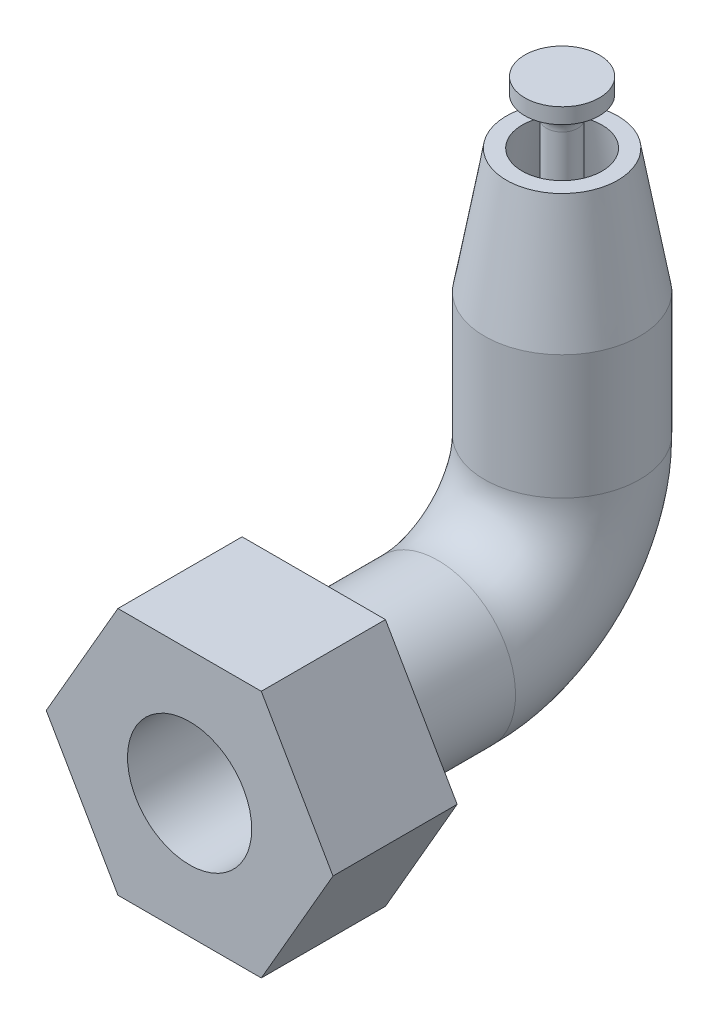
ISO-10303-21;
HEADER;
FILE_DESCRIPTION(('STEP AP214'),'2;1');
FILE_NAME('part.step','',(''),(''),'','','');
FILE_SCHEMA(('AUTOMOTIVE_DESIGN { 1 0 10303 214 1 1 1 1 }'));
ENDSEC;
DATA;
#1=APPLICATION_CONTEXT('core data for automotive mechanical design processes');
#2=APPLICATION_PROTOCOL_DEFINITION('international standard','automotive_design',2000,#1);
#3=PRODUCT_CONTEXT('',#1,'mechanical');
#4=PRODUCT('Part','Part','',(#3));
#5=PRODUCT_RELATED_PRODUCT_CATEGORY('part','',(#4));
#6=PRODUCT_DEFINITION_FORMATION('','',#4);
#7=PRODUCT_DEFINITION_CONTEXT('part definition',#1,'design');
#8=PRODUCT_DEFINITION('design','',#6,#7);
#9=PRODUCT_DEFINITION_SHAPE('','',#8);
#10=(LENGTH_UNIT() NAMED_UNIT(*) SI_UNIT(.MILLI.,.METRE.));
#11=(NAMED_UNIT(*) PLANE_ANGLE_UNIT() SI_UNIT($,.RADIAN.));
#12=(NAMED_UNIT(*) SI_UNIT($,.STERADIAN.) SOLID_ANGLE_UNIT());
#13=UNCERTAINTY_MEASURE_WITH_UNIT(LENGTH_MEASURE(1.E-05),#10,'distance_accuracy_value','');
#14=(GEOMETRIC_REPRESENTATION_CONTEXT(3) GLOBAL_UNCERTAINTY_ASSIGNED_CONTEXT((#13)) GLOBAL_UNIT_ASSIGNED_CONTEXT((#10,
#11,#12)) REPRESENTATION_CONTEXT('',''));
#15=CARTESIAN_POINT('',(0.,0.,0.));
#16=DIRECTION('',(0.,0.,1.));
#17=DIRECTION('',(1.,0.,0.));
#18=AXIS2_PLACEMENT_3D('',#15,#16,#17);
#19=CARTESIAN_POINT('',(0.,53.975,-38.7088176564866));
#20=DIRECTION('',(0.,-1.,0.));
#21=DIRECTION('',(0.,0.,-1.));
#22=AXIS2_PLACEMENT_3D('',#19,#20,#21);
#23=PLANE('',#22);
#24=CARTESIAN_POINT('',(-4.44499999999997,53.9750000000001,-58.4989658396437));
#25=DIRECTION('',(0.,1.,0.));
#26=DIRECTION('',(0.,0.,1.));
#27=AXIS2_PLACEMENT_3D('',#24,#25,#26);
#28=CIRCLE('',#27,2.54);
#29=CARTESIAN_POINT('',(-4.44499999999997,53.975,-55.9589658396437));
#30=VERTEX_POINT('',#29);
#31=EDGE_CURVE('E280',#30,#30,#28,.T.);
#32=ORIENTED_EDGE('',*,*,#31,.F.);
#33=EDGE_LOOP('',(#32));
#34=FACE_BOUND('',#33,.T.);
#35=CARTESIAN_POINT('',(4.44500000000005,53.9750000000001,-58.4989658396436));
#36=DIRECTION('',(0.,1.,0.));
#37=DIRECTION('',(0.,0.,1.));
#38=AXIS2_PLACEMENT_3D('',#35,#36,#37);
#39=CIRCLE('',#38,2.54);
#40=CARTESIAN_POINT('',(4.44500000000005,53.975,-55.9589658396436));
#41=VERTEX_POINT('',#40);
#42=EDGE_CURVE('E290',#41,#41,#39,.T.);
#43=ORIENTED_EDGE('',*,*,#42,.F.);
#44=EDGE_LOOP('',(#43));
#45=FACE_BOUND('',#44,.T.);
#46=CARTESIAN_POINT('',(8.89,53.975,-50.7999999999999));
#47=DIRECTION('',(0.,1.,0.));
#48=DIRECTION('',(0.,0.,1.));
#49=AXIS2_PLACEMENT_3D('',#46,#47,#48);
#50=CIRCLE('',#49,2.54);
#51=CARTESIAN_POINT('',(8.89,53.975,-48.2599999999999));
#52=VERTEX_POINT('',#51);
#53=EDGE_CURVE('E285',#52,#52,#50,.T.);
#54=ORIENTED_EDGE('',*,*,#53,.F.);
#55=EDGE_LOOP('',(#54));
#56=FACE_BOUND('',#55,.T.);
#57=CARTESIAN_POINT('',(4.44499999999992,53.975,-43.1010341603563));
#58=DIRECTION('',(0.,1.,0.));
#59=DIRECTION('',(0.,0.,1.));
#60=AXIS2_PLACEMENT_3D('',#57,#58,#59);
#61=CIRCLE('',#60,2.54);
#62=CARTESIAN_POINT('',(4.44499999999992,53.975,-40.5610341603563));
#63=VERTEX_POINT('',#62);
#64=EDGE_CURVE('E281',#63,#63,#61,.T.);
#65=ORIENTED_EDGE('',*,*,#64,.F.);
#66=EDGE_LOOP('',(#65));
#67=FACE_BOUND('',#66,.T.);
#68=CARTESIAN_POINT('',(-8.89,53.975,-50.8));
#69=DIRECTION('',(0.,1.,0.));
#70=DIRECTION('',(0.,0.,1.));
#71=AXIS2_PLACEMENT_3D('',#68,#69,#70);
#72=CIRCLE('',#71,2.54);
#73=CARTESIAN_POINT('',(-8.89,53.975,-48.26));
#74=VERTEX_POINT('',#73);
#75=EDGE_CURVE('E276',#74,#74,#72,.T.);
#76=ORIENTED_EDGE('',*,*,#75,.F.);
#77=EDGE_LOOP('',(#76));
#78=FACE_BOUND('',#77,.T.);
#79=CARTESIAN_POINT('',(0.,53.9750000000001,-50.8));
#80=DIRECTION('',(0.,-1.,0.));
#81=DIRECTION('',(0.,0.,-1.));
#82=AXIS2_PLACEMENT_3D('',#79,#80,#81);
#83=CIRCLE('',#82,12.0911823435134);
#84=CARTESIAN_POINT('',(0.,53.9750000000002,-62.8911823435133));
#85=VERTEX_POINT('',#84);
#86=EDGE_CURVE('E236',#85,#85,#83,.T.);
#87=ORIENTED_EDGE('',*,*,#86,.F.);
#88=EDGE_LOOP('',(#87));
#89=FACE_BOUND('',#88,.T.);
#90=CARTESIAN_POINT('',(0.,53.9750000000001,-50.8));
#91=DIRECTION('',(0.,-1.,0.));
#92=DIRECTION('',(0.,0.,-1.));
#93=AXIS2_PLACEMENT_3D('',#90,#91,#92);
#94=CIRCLE('',#93,3.17499999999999);
#95=CARTESIAN_POINT('',(0.,53.9750000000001,-53.975));
#96=VERTEX_POINT('',#95);
#97=EDGE_CURVE('E240',#96,#96,#94,.T.);
#98=ORIENTED_EDGE('',*,*,#97,.T.);
#99=EDGE_LOOP('',(#98));
#100=FACE_BOUND('',#99,.T.);
#101=CARTESIAN_POINT('',(-4.44500000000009,53.975,-43.1010341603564));
#102=DIRECTION('',(0.,1.,0.));
#103=DIRECTION('',(0.,0.,1.));
#104=AXIS2_PLACEMENT_3D('',#101,#102,#103);
#105=CIRCLE('',#104,2.54);
#106=CARTESIAN_POINT('',(-4.44500000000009,53.975,-40.5610341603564));
#107=VERTEX_POINT('',#106);
#108=EDGE_CURVE('E286',#107,#107,#105,.T.);
#109=ORIENTED_EDGE('',*,*,#108,.F.);
#110=EDGE_LOOP('',(#109));
#111=FACE_BOUND('',#110,.T.);
#112=ADVANCED_FACE('F63',(#34,#45,#56,#67,#78,#89,#100,#111),#23,.F.);
#113=CARTESIAN_POINT('',(0.,0.,25.4));
#114=DIRECTION('',(0.,0.,1.));
#115=DIRECTION('',(1.,0.,0.));
#116=AXIS2_PLACEMENT_3D('',#113,#114,#115);
#117=PLANE('',#116);
#118=DIRECTION('',(0.5,0.866025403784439,0.));
#119=VECTOR('',#118,1.);
#120=CARTESIAN_POINT('',(14.6646968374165,-25.4,25.4));
#121=LINE('',#120,#119);
#122=CARTESIAN_POINT('',(14.6646968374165,-25.4,25.4));
#123=VERTEX_POINT('',#122);
#124=CARTESIAN_POINT('',(29.329393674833,0.,25.4));
#125=VERTEX_POINT('',#124);
#126=EDGE_CURVE('E174',#123,#125,#121,.T.);
#127=ORIENTED_EDGE('',*,*,#126,.T.);
#128=DIRECTION('',(-0.5,0.866025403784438,0.));
#129=VECTOR('',#128,1.);
#130=CARTESIAN_POINT('',(29.329393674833,0.,25.4));
#131=LINE('',#130,#129);
#132=CARTESIAN_POINT('',(14.6646968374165,25.4,25.4));
#133=VERTEX_POINT('',#132);
#134=EDGE_CURVE('E121',#125,#133,#131,.T.);
#135=ORIENTED_EDGE('',*,*,#134,.T.);
#136=DIRECTION('',(-1.,0.,0.));
#137=VECTOR('',#136,1.);
#138=CARTESIAN_POINT('',(14.6646968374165,25.4,25.4));
#139=LINE('',#138,#137);
#140=CARTESIAN_POINT('',(-14.6646968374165,25.4,25.4));
#141=VERTEX_POINT('',#140);
#142=EDGE_CURVE('E135',#133,#141,#139,.T.);
#143=ORIENTED_EDGE('',*,*,#142,.T.);
#144=DIRECTION('',(-0.5,-0.866025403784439,0.));
#145=VECTOR('',#144,1.);
#146=CARTESIAN_POINT('',(-14.6646968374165,25.4,25.4));
#147=LINE('',#146,#145);
#148=CARTESIAN_POINT('',(-29.329393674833,0.,25.4));
#149=VERTEX_POINT('',#148);
#150=EDGE_CURVE('E128',#141,#149,#147,.T.);
#151=ORIENTED_EDGE('',*,*,#150,.T.);
#152=DIRECTION('',(0.5,-0.866025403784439,0.));
#153=VECTOR('',#152,1.);
#154=CARTESIAN_POINT('',(-29.329393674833,0.,25.4));
#155=LINE('',#154,#153);
#156=CARTESIAN_POINT('',(-14.6646968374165,-25.4,25.4));
#157=VERTEX_POINT('',#156);
#158=EDGE_CURVE('E133',#149,#157,#155,.T.);
#159=ORIENTED_EDGE('',*,*,#158,.T.);
#160=DIRECTION('',(1.,0.,0.));
#161=VECTOR('',#160,1.);
#162=CARTESIAN_POINT('',(-14.6646968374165,-25.4,25.4));
#163=LINE('',#162,#161);
#164=EDGE_CURVE('E83',#157,#123,#163,.T.);
#165=ORIENTED_EDGE('',*,*,#164,.T.);
#166=EDGE_LOOP('',(#127,#135,#143,#151,#159,#165));
#167=FACE_BOUND('',#166,.T.);
#168=CARTESIAN_POINT('',(0.,0.,25.4));
#169=DIRECTION('',(0.,0.,1.));
#170=DIRECTION('',(1.,0.,0.));
#171=AXIS2_PLACEMENT_3D('',#168,#169,#170);
#172=CIRCLE('',#171,12.7);
#173=CARTESIAN_POINT('',(12.7,0.,25.4));
#174=VERTEX_POINT('',#173);
#175=EDGE_CURVE('E162',#174,#174,#172,.T.);
#176=ORIENTED_EDGE('',*,*,#175,.F.);
#177=EDGE_LOOP('',(#176));
#178=FACE_BOUND('',#177,.T.);
#179=ADVANCED_FACE('F130',(#167,#178),#117,.T.);
#180=CARTESIAN_POINT('',(0.,0.,0.));
#181=DIRECTION('',(0.,0.,1.));
#182=DIRECTION('',(1.,0.,0.));
#183=AXIS2_PLACEMENT_3D('',#180,#181,#182);
#184=PLANE('',#183);
#185=CARTESIAN_POINT('',(0.,0.,0.));
#186=DIRECTION('',(0.,0.,-1.));
#187=DIRECTION('',(-1.,0.,0.));
#188=AXIS2_PLACEMENT_3D('',#185,#186,#187);
#189=CIRCLE('',#188,15.875);
#190=CARTESIAN_POINT('',(-15.875,0.,0.));
#191=VERTEX_POINT('',#190);
#192=EDGE_CURVE('E13',#191,#191,#189,.T.);
#193=ORIENTED_EDGE('',*,*,#192,.F.);
#194=EDGE_LOOP('',(#193));
#195=FACE_BOUND('',#194,.T.);
#196=DIRECTION('',(0.5,0.866025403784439,0.));
#197=VECTOR('',#196,1.);
#198=CARTESIAN_POINT('',(14.6646968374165,-25.4,0.));
#199=LINE('',#198,#197);
#200=CARTESIAN_POINT('',(14.6646968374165,-25.4,0.));
#201=VERTEX_POINT('',#200);
#202=CARTESIAN_POINT('',(29.329393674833,0.,0.));
#203=VERTEX_POINT('',#202);
#204=EDGE_CURVE('E157',#201,#203,#199,.T.);
#205=ORIENTED_EDGE('',*,*,#204,.F.);
#206=DIRECTION('',(1.,0.,0.));
#207=VECTOR('',#206,1.);
#208=CARTESIAN_POINT('',(-14.6646968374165,-25.4,0.));
#209=LINE('',#208,#207);
#210=CARTESIAN_POINT('',(-14.6646968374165,-25.4,0.));
#211=VERTEX_POINT('',#210);
#212=EDGE_CURVE('E112',#211,#201,#209,.T.);
#213=ORIENTED_EDGE('',*,*,#212,.F.);
#214=DIRECTION('',(0.5,-0.866025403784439,0.));
#215=VECTOR('',#214,1.);
#216=CARTESIAN_POINT('',(-29.329393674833,0.,0.));
#217=LINE('',#216,#215);
#218=CARTESIAN_POINT('',(-29.329393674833,0.,0.));
#219=VERTEX_POINT('',#218);
#220=EDGE_CURVE('E106',#219,#211,#217,.T.);
#221=ORIENTED_EDGE('',*,*,#220,.F.);
#222=DIRECTION('',(-0.5,-0.866025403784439,0.));
#223=VECTOR('',#222,1.);
#224=CARTESIAN_POINT('',(-14.6646968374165,25.4,0.));
#225=LINE('',#224,#223);
#226=CARTESIAN_POINT('',(-14.6646968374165,25.4,0.));
#227=VERTEX_POINT('',#226);
#228=EDGE_CURVE('E144',#227,#219,#225,.T.);
#229=ORIENTED_EDGE('',*,*,#228,.F.);
#230=DIRECTION('',(-1.,0.,0.));
#231=VECTOR('',#230,1.);
#232=CARTESIAN_POINT('',(14.6646968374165,25.4,0.));
#233=LINE('',#232,#231);
#234=CARTESIAN_POINT('',(14.6646968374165,25.4,0.));
#235=VERTEX_POINT('',#234);
#236=EDGE_CURVE('E165',#235,#227,#233,.T.);
#237=ORIENTED_EDGE('',*,*,#236,.F.);
#238=DIRECTION('',(-0.5,0.866025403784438,0.));
#239=VECTOR('',#238,1.);
#240=CARTESIAN_POINT('',(29.329393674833,0.,0.));
#241=LINE('',#240,#239);
#242=EDGE_CURVE('E161',#203,#235,#241,.T.);
#243=ORIENTED_EDGE('',*,*,#242,.F.);
#244=EDGE_LOOP('',(#205,#213,#221,#229,#237,#243));
#245=FACE_BOUND('',#244,.T.);
#246=ADVANCED_FACE('F191',(#195,#245),#184,.F.);
#247=CARTESIAN_POINT('',(14.6646968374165,-25.4,25.4));
#248=DIRECTION('',(-0.866025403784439,0.5,0.));
#249=DIRECTION('',(-0.5,-0.866025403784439,0.));
#250=AXIS2_PLACEMENT_3D('',#247,#248,#249);
#251=PLANE('',#250);
#252=ORIENTED_EDGE('',*,*,#204,.T.);
#253=DIRECTION('',(0.,0.,-1.));
#254=VECTOR('',#253,1.);
#255=CARTESIAN_POINT('',(29.329393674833,0.,25.4));
#256=LINE('',#255,#254);
#257=EDGE_CURVE('E74',#125,#203,#256,.T.);
#258=ORIENTED_EDGE('',*,*,#257,.F.);
#259=ORIENTED_EDGE('',*,*,#126,.F.);
#260=DIRECTION('',(0.,0.,-1.));
#261=VECTOR('',#260,1.);
#262=CARTESIAN_POINT('',(14.6646968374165,-25.4,25.4));
#263=LINE('',#262,#261);
#264=EDGE_CURVE('E153',#123,#201,#263,.T.);
#265=ORIENTED_EDGE('',*,*,#264,.T.);
#266=EDGE_LOOP('',(#252,#258,#259,#265));
#267=FACE_BOUND('',#266,.T.);
#268=ADVANCED_FACE('F65',(#267),#251,.F.);
#269=CARTESIAN_POINT('',(29.329393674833,0.,25.4));
#270=DIRECTION('',(-0.866025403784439,-0.5,0.));
#271=DIRECTION('',(0.5,-0.866025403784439,0.));
#272=AXIS2_PLACEMENT_3D('',#269,#270,#271);
#273=PLANE('',#272);
#274=ORIENTED_EDGE('',*,*,#242,.T.);
#275=DIRECTION('',(0.,0.,-1.));
#276=VECTOR('',#275,1.);
#277=CARTESIAN_POINT('',(14.6646968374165,25.4,25.4));
#278=LINE('',#277,#276);
#279=EDGE_CURVE('E181',#133,#235,#278,.T.);
#280=ORIENTED_EDGE('',*,*,#279,.F.);
#281=ORIENTED_EDGE('',*,*,#134,.F.);
#282=ORIENTED_EDGE('',*,*,#257,.T.);
#283=EDGE_LOOP('',(#274,#280,#281,#282));
#284=FACE_BOUND('',#283,.T.);
#285=ADVANCED_FACE('F186',(#284),#273,.F.);
#286=CARTESIAN_POINT('',(14.6646968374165,25.4,25.4));
#287=DIRECTION('',(0.,-1.,0.));
#288=DIRECTION('',(0.,0.,-1.));
#289=AXIS2_PLACEMENT_3D('',#286,#287,#288);
#290=PLANE('',#289);
#291=ORIENTED_EDGE('',*,*,#236,.T.);
#292=DIRECTION('',(0.,0.,-1.));
#293=VECTOR('',#292,1.);
#294=CARTESIAN_POINT('',(-14.6646968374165,25.4,25.4));
#295=LINE('',#294,#293);
#296=EDGE_CURVE('E146',#141,#227,#295,.T.);
#297=ORIENTED_EDGE('',*,*,#296,.F.);
#298=ORIENTED_EDGE('',*,*,#142,.F.);
#299=ORIENTED_EDGE('',*,*,#279,.T.);
#300=EDGE_LOOP('',(#291,#297,#298,#299));
#301=FACE_BOUND('',#300,.T.);
#302=ADVANCED_FACE('F194',(#301),#290,.F.);
#303=CARTESIAN_POINT('',(-14.6646968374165,25.4,25.4));
#304=DIRECTION('',(0.866025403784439,-0.5,0.));
#305=DIRECTION('',(0.5,0.866025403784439,0.));
#306=AXIS2_PLACEMENT_3D('',#303,#304,#305);
#307=PLANE('',#306);
#308=ORIENTED_EDGE('',*,*,#228,.T.);
#309=DIRECTION('',(0.,0.,-1.));
#310=VECTOR('',#309,1.);
#311=CARTESIAN_POINT('',(-29.329393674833,0.,25.4));
#312=LINE('',#311,#310);
#313=EDGE_CURVE('E141',#149,#219,#312,.T.);
#314=ORIENTED_EDGE('',*,*,#313,.F.);
#315=ORIENTED_EDGE('',*,*,#150,.F.);
#316=ORIENTED_EDGE('',*,*,#296,.T.);
#317=EDGE_LOOP('',(#308,#314,#315,#316));
#318=FACE_BOUND('',#317,.T.);
#319=ADVANCED_FACE('F142',(#318),#307,.F.);
#320=CARTESIAN_POINT('',(-29.329393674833,0.,25.4));
#321=DIRECTION('',(0.866025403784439,0.5,0.));
#322=DIRECTION('',(-0.5,0.866025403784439,0.));
#323=AXIS2_PLACEMENT_3D('',#320,#321,#322);
#324=PLANE('',#323);
#325=ORIENTED_EDGE('',*,*,#220,.T.);
#326=DIRECTION('',(0.,0.,-1.));
#327=VECTOR('',#326,1.);
#328=CARTESIAN_POINT('',(-14.6646968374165,-25.4,25.4));
#329=LINE('',#328,#327);
#330=EDGE_CURVE('E147',#157,#211,#329,.T.);
#331=ORIENTED_EDGE('',*,*,#330,.F.);
#332=ORIENTED_EDGE('',*,*,#158,.F.);
#333=ORIENTED_EDGE('',*,*,#313,.T.);
#334=EDGE_LOOP('',(#325,#331,#332,#333));
#335=FACE_BOUND('',#334,.T.);
#336=ADVANCED_FACE('F149',(#335),#324,.F.);
#337=CARTESIAN_POINT('',(-14.6646968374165,-25.4,25.4));
#338=DIRECTION('',(0.,1.,0.));
#339=DIRECTION('',(-1.,0.,0.));
#340=AXIS2_PLACEMENT_3D('',#337,#338,#339);
#341=PLANE('',#340);
#342=ORIENTED_EDGE('',*,*,#212,.T.);
#343=ORIENTED_EDGE('',*,*,#264,.F.);
#344=ORIENTED_EDGE('',*,*,#164,.F.);
#345=ORIENTED_EDGE('',*,*,#330,.T.);
#346=EDGE_LOOP('',(#342,#343,#344,#345));
#347=FACE_BOUND('',#346,.T.);
#348=ADVANCED_FACE('F355',(#347),#341,.F.);
#349=CARTESIAN_POINT('',(0.,0.,25.4));
#350=DIRECTION('',(0.,0.,-1.));
#351=DIRECTION('',(-1.,0.,0.));
#352=AXIS2_PLACEMENT_3D('',#349,#350,#351);
#353=CYLINDRICAL_SURFACE('',#352,12.7);
#354=ORIENTED_EDGE('',*,*,#175,.T.);
#355=EDGE_LOOP('',(#354));
#356=FACE_BOUND('',#355,.T.);
#357=CARTESIAN_POINT('',(0.,0.,-25.4));
#358=DIRECTION('',(0.,0.,-1.));
#359=DIRECTION('',(-1.,0.,0.));
#360=AXIS2_PLACEMENT_3D('',#357,#358,#359);
#361=CIRCLE('',#360,12.7);
#362=CARTESIAN_POINT('',(0.,-12.7,-25.4));
#363=VERTEX_POINT('',#362);
#364=EDGE_CURVE('E218',#363,#363,#361,.F.);
#365=ORIENTED_EDGE('',*,*,#364,.F.);
#366=EDGE_LOOP('',(#365));
#367=FACE_BOUND('',#366,.T.);
#368=ADVANCED_FACE('F343',(#356,#367),#353,.F.);
#369=CARTESIAN_POINT('',(0.,0.,0.));
#370=DIRECTION('',(0.,0.,-1.));
#371=DIRECTION('',(-1.,0.,0.));
#372=AXIS2_PLACEMENT_3D('',#369,#370,#371);
#373=CYLINDRICAL_SURFACE('',#372,15.875);
#374=CARTESIAN_POINT('',(0.,0.,-25.4));
#375=DIRECTION('',(0.,0.,-1.));
#376=DIRECTION('',(-1.,0.,0.));
#377=AXIS2_PLACEMENT_3D('',#374,#375,#376);
#378=CIRCLE('',#377,15.875);
#379=CARTESIAN_POINT('',(0.,-15.875,-25.4));
#380=VERTEX_POINT('',#379);
#381=EDGE_CURVE('E210',#380,#380,#378,.T.);
#382=ORIENTED_EDGE('',*,*,#381,.F.);
#383=EDGE_LOOP('',(#382));
#384=FACE_BOUND('',#383,.T.);
#385=ORIENTED_EDGE('',*,*,#192,.T.);
#386=EDGE_LOOP('',(#385));
#387=FACE_BOUND('',#386,.T.);
#388=ADVANCED_FACE('F334',(#384,#387),#373,.T.);
#389=CARTESIAN_POINT('',(0.,25.4,-25.4));
#390=DIRECTION('',(1.,0.,0.));
#391=DIRECTION('',(0.,0.,-1.));
#392=AXIS2_PLACEMENT_3D('',#389,#390,#391);
#393=TOROIDAL_SURFACE('',#392,25.4,15.875);
#394=CARTESIAN_POINT('',(0.,25.4,-50.8));
#395=DIRECTION('',(0.,1.,0.));
#396=DIRECTION('',(-1.,0.,0.));
#397=AXIS2_PLACEMENT_3D('',#394,#395,#396);
#398=CIRCLE('',#397,15.875);
#399=CARTESIAN_POINT('',(0.,25.4,-66.675));
#400=VERTEX_POINT('',#399);
#401=EDGE_CURVE('E205',#400,#400,#398,.T.);
#402=CARTESIAN_POINT('',(0.,25.4,-25.4));
#403=DIRECTION('',(1.,0.,0.));
#404=DIRECTION('',(0.,0.,-1.));
#405=AXIS2_PLACEMENT_3D('',#402,#403,#404);
#406=CIRCLE('',#405,41.275);
#407=EDGE_CURVE('',#380,#400,#406,.T.);
#408=ORIENTED_EDGE('',*,*,#381,.T.);
#409=ORIENTED_EDGE('',*,*,#401,.F.);
#410=ORIENTED_EDGE('',*,*,#407,.T.);
#411=ORIENTED_EDGE('',*,*,#407,.F.);
#412=EDGE_LOOP('',(#408,#410,#409,#411));
#413=FACE_BOUND('',#412,.T.);
#414=ADVANCED_FACE('F346',(#413),#393,.T.);
#415=CARTESIAN_POINT('',(0.,25.4,-50.8));
#416=DIRECTION('',(0.,1.,0.));
#417=DIRECTION('',(0.,0.,1.));
#418=AXIS2_PLACEMENT_3D('',#415,#416,#417);
#419=CYLINDRICAL_SURFACE('',#418,15.875);
#420=CARTESIAN_POINT('',(0.,50.8,-50.8));
#421=DIRECTION('',(0.,1.,0.));
#422=DIRECTION('',(-1.,0.,0.));
#423=AXIS2_PLACEMENT_3D('',#420,#421,#422);
#424=CIRCLE('',#423,15.875);
#425=CARTESIAN_POINT('',(-15.875,50.8,-50.8));
#426=VERTEX_POINT('',#425);
#427=EDGE_CURVE('E209',#426,#426,#424,.T.);
#428=ORIENTED_EDGE('',*,*,#427,.F.);
#429=EDGE_LOOP('',(#428));
#430=FACE_BOUND('',#429,.T.);
#431=ORIENTED_EDGE('',*,*,#401,.T.);
#432=EDGE_LOOP('',(#431));
#433=FACE_BOUND('',#432,.T.);
#434=ADVANCED_FACE('F338',(#430,#433),#419,.T.);
#435=CARTESIAN_POINT('',(0.,25.4,-25.4));
#436=DIRECTION('',(1.,0.,0.));
#437=DIRECTION('',(0.,0.,-1.));
#438=AXIS2_PLACEMENT_3D('',#435,#436,#437);
#439=TOROIDAL_SURFACE('',#438,25.4,12.7);
#440=CARTESIAN_POINT('',(0.,25.4,-50.8));
#441=DIRECTION('',(0.,1.,0.));
#442=DIRECTION('',(-1.,0.,0.));
#443=AXIS2_PLACEMENT_3D('',#440,#441,#442);
#444=CIRCLE('',#443,12.7);
#445=CARTESIAN_POINT('',(0.,25.4,-63.5));
#446=VERTEX_POINT('',#445);
#447=EDGE_CURVE('E222',#446,#446,#444,.F.);
#448=CARTESIAN_POINT('',(0.,25.4,-25.4));
#449=DIRECTION('',(1.,0.,0.));
#450=DIRECTION('',(0.,0.,-1.));
#451=AXIS2_PLACEMENT_3D('',#448,#449,#450);
#452=CIRCLE('',#451,38.1);
#453=EDGE_CURVE('',#363,#446,#452,.T.);
#454=ORIENTED_EDGE('',*,*,#364,.T.);
#455=ORIENTED_EDGE('',*,*,#447,.F.);
#456=ORIENTED_EDGE('',*,*,#453,.T.);
#457=ORIENTED_EDGE('',*,*,#453,.F.);
#458=EDGE_LOOP('',(#454,#456,#455,#457));
#459=FACE_BOUND('',#458,.T.);
#460=ADVANCED_FACE('F335',(#459),#439,.F.);
#461=CARTESIAN_POINT('',(0.,25.4,-50.8));
#462=DIRECTION('',(0.,1.,0.));
#463=DIRECTION('',(0.,0.,1.));
#464=AXIS2_PLACEMENT_3D('',#461,#462,#463);
#465=CYLINDRICAL_SURFACE('',#464,12.7);
#466=CARTESIAN_POINT('',(0.,50.8,-50.8));
#467=DIRECTION('',(0.,1.,0.));
#468=DIRECTION('',(-1.,0.,0.));
#469=AXIS2_PLACEMENT_3D('',#466,#467,#468);
#470=CIRCLE('',#469,12.7);
#471=CARTESIAN_POINT('',(-12.7,50.8,-50.8));
#472=VERTEX_POINT('',#471);
#473=EDGE_CURVE('E204',#472,#472,#470,.F.);
#474=ORIENTED_EDGE('',*,*,#473,.F.);
#475=EDGE_LOOP('',(#474));
#476=FACE_BOUND('',#475,.T.);
#477=ORIENTED_EDGE('',*,*,#447,.T.);
#478=EDGE_LOOP('',(#477));
#479=FACE_BOUND('',#478,.T.);
#480=ADVANCED_FACE('F332',(#476,#479),#465,.F.);
#481=CARTESIAN_POINT('',(0.,50.8,-50.8));
#482=DIRECTION('',(0.,1.,0.));
#483=DIRECTION('',(0.,0.,1.));
#484=AXIS2_PLACEMENT_3D('',#481,#482,#483);
#485=PLANE('',#484);
#486=CARTESIAN_POINT('',(-4.44499999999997,50.8000000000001,-58.4989658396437));
#487=DIRECTION('',(0.,1.,0.));
#488=DIRECTION('',(0.,0.,1.));
#489=AXIS2_PLACEMENT_3D('',#486,#487,#488);
#490=CIRCLE('',#489,2.54);
#491=CARTESIAN_POINT('',(-4.44499999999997,50.8,-55.9589658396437));
#492=VERTEX_POINT('',#491);
#493=EDGE_CURVE('E256',#492,#492,#490,.T.);
#494=ORIENTED_EDGE('',*,*,#493,.T.);
#495=EDGE_LOOP('',(#494));
#496=FACE_BOUND('',#495,.T.);
#497=CARTESIAN_POINT('',(4.44500000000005,50.8000000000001,-58.4989658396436));
#498=DIRECTION('',(0.,1.,0.));
#499=DIRECTION('',(0.,0.,1.));
#500=AXIS2_PLACEMENT_3D('',#497,#498,#499);
#501=CIRCLE('',#500,2.54);
#502=CARTESIAN_POINT('',(4.44500000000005,50.8,-55.9589658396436));
#503=VERTEX_POINT('',#502);
#504=EDGE_CURVE('E260',#503,#503,#501,.T.);
#505=ORIENTED_EDGE('',*,*,#504,.T.);
#506=EDGE_LOOP('',(#505));
#507=FACE_BOUND('',#506,.T.);
#508=CARTESIAN_POINT('',(8.89,50.8,-50.7999999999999));
#509=DIRECTION('',(0.,1.,0.));
#510=DIRECTION('',(0.,0.,1.));
#511=AXIS2_PLACEMENT_3D('',#508,#509,#510);
#512=CIRCLE('',#511,2.54);
#513=CARTESIAN_POINT('',(8.89,50.8,-48.2599999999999));
#514=VERTEX_POINT('',#513);
#515=EDGE_CURVE('E264',#514,#514,#512,.T.);
#516=ORIENTED_EDGE('',*,*,#515,.T.);
#517=EDGE_LOOP('',(#516));
#518=FACE_BOUND('',#517,.T.);
#519=CARTESIAN_POINT('',(4.44499999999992,50.8,-43.1010341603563));
#520=DIRECTION('',(0.,1.,0.));
#521=DIRECTION('',(0.,0.,1.));
#522=AXIS2_PLACEMENT_3D('',#519,#520,#521);
#523=CIRCLE('',#522,2.54);
#524=CARTESIAN_POINT('',(4.44499999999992,50.8,-40.5610341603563));
#525=VERTEX_POINT('',#524);
#526=EDGE_CURVE('E268',#525,#525,#523,.T.);
#527=ORIENTED_EDGE('',*,*,#526,.T.);
#528=EDGE_LOOP('',(#527));
#529=FACE_BOUND('',#528,.T.);
#530=CARTESIAN_POINT('',(-4.44500000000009,50.8,-43.1010341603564));
#531=DIRECTION('',(0.,1.,0.));
#532=DIRECTION('',(0.,0.,1.));
#533=AXIS2_PLACEMENT_3D('',#530,#531,#532);
#534=CIRCLE('',#533,2.54);
#535=CARTESIAN_POINT('',(-4.44500000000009,50.8,-40.5610341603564));
#536=VERTEX_POINT('',#535);
#537=EDGE_CURVE('E67',#536,#536,#534,.T.);
#538=ORIENTED_EDGE('',*,*,#537,.T.);
#539=EDGE_LOOP('',(#538));
#540=FACE_BOUND('',#539,.T.);
#541=CARTESIAN_POINT('',(-8.89,50.8,-50.8));
#542=DIRECTION('',(0.,1.,0.));
#543=DIRECTION('',(0.,0.,1.));
#544=AXIS2_PLACEMENT_3D('',#541,#542,#543);
#545=CIRCLE('',#544,2.54);
#546=CARTESIAN_POINT('',(-8.89,50.8,-48.26));
#547=VERTEX_POINT('',#546);
#548=EDGE_CURVE('E272',#547,#547,#545,.T.);
#549=ORIENTED_EDGE('',*,*,#548,.T.);
#550=EDGE_LOOP('',(#549));
#551=FACE_BOUND('',#550,.T.);
#552=ORIENTED_EDGE('',*,*,#473,.T.);
#553=EDGE_LOOP('',(#552));
#554=FACE_BOUND('',#553,.T.);
#555=ADVANCED_FACE('F328',(#496,#507,#518,#529,#540,#551,#554),#485,.F.);
#556=CARTESIAN_POINT('',(0.,76.2,-50.7999999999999));
#557=DIRECTION('',(0.,-1.,0.));
#558=DIRECTION('',(0.,0.,-1.));
#559=AXIS2_PLACEMENT_3D('',#556,#557,#558);
#560=CONICAL_SURFACE('',#559,11.3962946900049,0.174532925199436);
#561=ORIENTED_EDGE('',*,*,#427,.T.);
#562=EDGE_LOOP('',(#561));
#563=FACE_BOUND('',#562,.T.);
#564=CARTESIAN_POINT('',(0.,76.2,-50.7999999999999));
#565=DIRECTION('',(0.,-1.,0.));
#566=DIRECTION('',(0.,0.,-1.));
#567=AXIS2_PLACEMENT_3D('',#564,#565,#566);
#568=CIRCLE('',#567,11.3962946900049);
#569=CARTESIAN_POINT('',(0.,76.2000000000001,-62.1962946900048));
#570=VERTEX_POINT('',#569);
#571=EDGE_CURVE('E213',#570,#570,#568,.T.);
#572=ORIENTED_EDGE('',*,*,#571,.T.);
#573=EDGE_LOOP('',(#572));
#574=FACE_BOUND('',#573,.T.);
#575=ADVANCED_FACE('F324',(#563,#574),#560,.T.);
#576=CARTESIAN_POINT('',(0.,76.2,-39.403705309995));
#577=DIRECTION('',(0.,-1.,0.));
#578=DIRECTION('',(0.,0.,-1.));
#579=AXIS2_PLACEMENT_3D('',#576,#577,#578);
#580=PLANE('',#579);
#581=ORIENTED_EDGE('',*,*,#571,.F.);
#582=EDGE_LOOP('',(#581));
#583=FACE_BOUND('',#582,.T.);
#584=CARTESIAN_POINT('',(0.,76.2,-50.7999999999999));
#585=DIRECTION('',(0.,-1.,0.));
#586=DIRECTION('',(0.,0.,-1.));
#587=AXIS2_PLACEMENT_3D('',#584,#585,#586);
#588=CIRCLE('',#587,8.17231519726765);
#589=CARTESIAN_POINT('',(0.,76.2000000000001,-58.9723151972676));
#590=VERTEX_POINT('',#589);
#591=EDGE_CURVE('E232',#590,#590,#588,.T.);
#592=ORIENTED_EDGE('',*,*,#591,.T.);
#593=EDGE_LOOP('',(#592));
#594=FACE_BOUND('',#593,.T.);
#595=ADVANCED_FACE('F320',(#583,#594),#580,.F.);
#596=CARTESIAN_POINT('',(0.,53.9750000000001,-50.8));
#597=DIRECTION('',(0.,-1.,0.));
#598=DIRECTION('',(0.,0.,-1.));
#599=AXIS2_PLACEMENT_3D('',#596,#597,#598);
#600=CONICAL_SURFACE('',#599,12.0911823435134,0.174532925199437);
#601=ORIENTED_EDGE('',*,*,#591,.F.);
#602=EDGE_LOOP('',(#601));
#603=FACE_BOUND('',#602,.T.);
#604=ORIENTED_EDGE('',*,*,#86,.T.);
#605=EDGE_LOOP('',(#604));
#606=FACE_BOUND('',#605,.T.);
#607=ADVANCED_FACE('F317',(#603,#606),#600,.F.);
#608=CARTESIAN_POINT('',(0.,-949.2,-50.8000000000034));
#609=DIRECTION('',(0.,-1.,0.));
#610=DIRECTION('',(0.,0.,-1.));
#611=AXIS2_PLACEMENT_3D('',#608,#609,#610);
#612=CYLINDRICAL_SURFACE('',#611,3.17499999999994);
#613=ORIENTED_EDGE('',*,*,#97,.F.);
#614=EDGE_LOOP('',(#613));
#615=FACE_BOUND('',#614,.T.);
#616=CARTESIAN_POINT('',(0.,81.28,-50.7999999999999));
#617=DIRECTION('',(0.,-1.,0.));
#618=DIRECTION('',(0.,0.,-1.));
#619=AXIS2_PLACEMENT_3D('',#616,#617,#618);
#620=CIRCLE('',#619,3.1749999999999);
#621=CARTESIAN_POINT('',(0.,81.28,-53.9749999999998));
#622=VERTEX_POINT('',#621);
#623=EDGE_CURVE('E244',#622,#622,#620,.T.);
#624=ORIENTED_EDGE('',*,*,#623,.T.);
#625=EDGE_LOOP('',(#624));
#626=FACE_BOUND('',#625,.T.);
#627=ADVANCED_FACE('F315',(#615,#626),#612,.T.);
#628=CARTESIAN_POINT('',(0.,81.28,-50.7999999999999));
#629=DIRECTION('',(0.,-1.,0.));
#630=DIRECTION('',(0.,0.,-1.));
#631=AXIS2_PLACEMENT_3D('',#628,#629,#630);
#632=TOROIDAL_SURFACE('',#631,7.61999999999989,4.445);
#633=ORIENTED_EDGE('',*,*,#623,.F.);
#634=EDGE_LOOP('',(#633));
#635=FACE_BOUND('',#634,.T.);
#636=CARTESIAN_POINT('',(0.,85.7250000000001,-50.7999999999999));
#637=DIRECTION('',(0.,-1.,0.));
#638=DIRECTION('',(0.,0.,-1.));
#639=AXIS2_PLACEMENT_3D('',#636,#637,#638);
#640=CIRCLE('',#639,7.61999999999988);
#641=CARTESIAN_POINT('',(0.,85.7250000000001,-58.4199999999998));
#642=VERTEX_POINT('',#641);
#643=EDGE_CURVE('E248',#642,#642,#640,.T.);
#644=ORIENTED_EDGE('',*,*,#643,.T.);
#645=EDGE_LOOP('',(#644));
#646=FACE_BOUND('',#645,.T.);
#647=ADVANCED_FACE('F475',(#635,#646),#632,.F.);
#648=CARTESIAN_POINT('',(0.,-949.2,-50.8000000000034));
#649=DIRECTION('',(0.,-1.,0.));
#650=DIRECTION('',(0.,0.,-1.));
#651=AXIS2_PLACEMENT_3D('',#648,#649,#650);
#652=CYLINDRICAL_SURFACE('',#651,7.61999999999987);
#653=ORIENTED_EDGE('',*,*,#643,.F.);
#654=EDGE_LOOP('',(#653));
#655=FACE_BOUND('',#654,.T.);
#656=CARTESIAN_POINT('',(0.,88.9,-50.7999999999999));
#657=DIRECTION('',(0.,-1.,0.));
#658=DIRECTION('',(0.,0.,-1.));
#659=AXIS2_PLACEMENT_3D('',#656,#657,#658);
#660=CIRCLE('',#659,7.61999999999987);
#661=CARTESIAN_POINT('',(0.,88.9,-58.4199999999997));
#662=VERTEX_POINT('',#661);
#663=EDGE_CURVE('E252',#662,#662,#660,.T.);
#664=ORIENTED_EDGE('',*,*,#663,.T.);
#665=EDGE_LOOP('',(#664));
#666=FACE_BOUND('',#665,.T.);
#667=ADVANCED_FACE('F472',(#655,#666),#652,.T.);
#668=CARTESIAN_POINT('',(0.,88.9,-50.8));
#669=DIRECTION('',(0.,-1.,0.));
#670=DIRECTION('',(0.,0.,-1.));
#671=AXIS2_PLACEMENT_3D('',#668,#669,#670);
#672=PLANE('',#671);
#673=ORIENTED_EDGE('',*,*,#663,.F.);
#674=EDGE_LOOP('',(#673));
#675=FACE_BOUND('',#674,.T.);
#676=ADVANCED_FACE('F396',(#675),#672,.F.);
#677=CARTESIAN_POINT('',(-8.89,22.225,-50.8000000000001));
#678=DIRECTION('',(0.,1.,0.));
#679=DIRECTION('',(0.,0.,1.));
#680=AXIS2_PLACEMENT_3D('',#677,#678,#679);
#681=CYLINDRICAL_SURFACE('',#680,2.54);
#682=ORIENTED_EDGE('',*,*,#75,.T.);
#683=EDGE_LOOP('',(#682));
#684=FACE_BOUND('',#683,.T.);
#685=ORIENTED_EDGE('',*,*,#548,.F.);
#686=EDGE_LOOP('',(#685));
#687=FACE_BOUND('',#686,.T.);
#688=ADVANCED_FACE('F413',(#684,#687),#681,.F.);
#689=CARTESIAN_POINT('',(4.44499999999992,22.225,-43.1010341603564));
#690=DIRECTION('',(0.,1.,0.));
#691=DIRECTION('',(0.,0.,1.));
#692=AXIS2_PLACEMENT_3D('',#689,#690,#691);
#693=CYLINDRICAL_SURFACE('',#692,2.54);
#694=ORIENTED_EDGE('',*,*,#64,.T.);
#695=EDGE_LOOP('',(#694));
#696=FACE_BOUND('',#695,.T.);
#697=ORIENTED_EDGE('',*,*,#526,.F.);
#698=EDGE_LOOP('',(#697));
#699=FACE_BOUND('',#698,.T.);
#700=ADVANCED_FACE('F417',(#696,#699),#693,.F.);
#701=CARTESIAN_POINT('',(8.89,22.225,-50.8));
#702=DIRECTION('',(0.,1.,0.));
#703=DIRECTION('',(0.,0.,1.));
#704=AXIS2_PLACEMENT_3D('',#701,#702,#703);
#705=CYLINDRICAL_SURFACE('',#704,2.54);
#706=ORIENTED_EDGE('',*,*,#53,.T.);
#707=EDGE_LOOP('',(#706));
#708=FACE_BOUND('',#707,.T.);
#709=ORIENTED_EDGE('',*,*,#515,.F.);
#710=EDGE_LOOP('',(#709));
#711=FACE_BOUND('',#710,.T.);
#712=ADVANCED_FACE('F425',(#708,#711),#705,.F.);
#713=CARTESIAN_POINT('',(4.44500000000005,22.2250000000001,-58.4989658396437));
#714=DIRECTION('',(0.,1.,0.));
#715=DIRECTION('',(0.,0.,1.));
#716=AXIS2_PLACEMENT_3D('',#713,#714,#715);
#717=CYLINDRICAL_SURFACE('',#716,2.54);
#718=ORIENTED_EDGE('',*,*,#42,.T.);
#719=EDGE_LOOP('',(#718));
#720=FACE_BOUND('',#719,.T.);
#721=ORIENTED_EDGE('',*,*,#504,.F.);
#722=EDGE_LOOP('',(#721));
#723=FACE_BOUND('',#722,.T.);
#724=ADVANCED_FACE('F434',(#720,#723),#717,.F.);
#725=CARTESIAN_POINT('',(-4.44499999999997,22.2250000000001,-58.4989658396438));
#726=DIRECTION('',(0.,1.,0.));
#727=DIRECTION('',(0.,0.,1.));
#728=AXIS2_PLACEMENT_3D('',#725,#726,#727);
#729=CYLINDRICAL_SURFACE('',#728,2.54);
#730=ORIENTED_EDGE('',*,*,#31,.T.);
#731=EDGE_LOOP('',(#730));
#732=FACE_BOUND('',#731,.T.);
#733=ORIENTED_EDGE('',*,*,#493,.F.);
#734=EDGE_LOOP('',(#733));
#735=FACE_BOUND('',#734,.T.);
#736=ADVANCED_FACE('F443',(#732,#735),#729,.F.);
#737=CARTESIAN_POINT('',(-4.44500000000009,22.225,-43.1010341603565));
#738=DIRECTION('',(0.,1.,0.));
#739=DIRECTION('',(0.,0.,1.));
#740=AXIS2_PLACEMENT_3D('',#737,#738,#739);
#741=CYLINDRICAL_SURFACE('',#740,2.54);
#742=ORIENTED_EDGE('',*,*,#108,.T.);
#743=EDGE_LOOP('',(#742));
#744=FACE_BOUND('',#743,.T.);
#745=ORIENTED_EDGE('',*,*,#537,.F.);
#746=EDGE_LOOP('',(#745));
#747=FACE_BOUND('',#746,.T.);
#748=ADVANCED_FACE('F301',(#744,#747),#741,.F.);
#749=CLOSED_SHELL('',(#112,#179,#246,#268,#285,#302,#319,#336,#348,#368,#388,#414,#434,#460,
#480,#555,#575,#595,#607,#627,#647,#667,#676,#688,#700,#712,#724,#736,#748));
#750=MANIFOLD_SOLID_BREP('B2',#749);
#751=ADVANCED_BREP_SHAPE_REPRESENTATION('',(#18,#750),#14);
#752=SHAPE_DEFINITION_REPRESENTATION(#9,#751);
ENDSEC;
END-ISO-10303-21;
